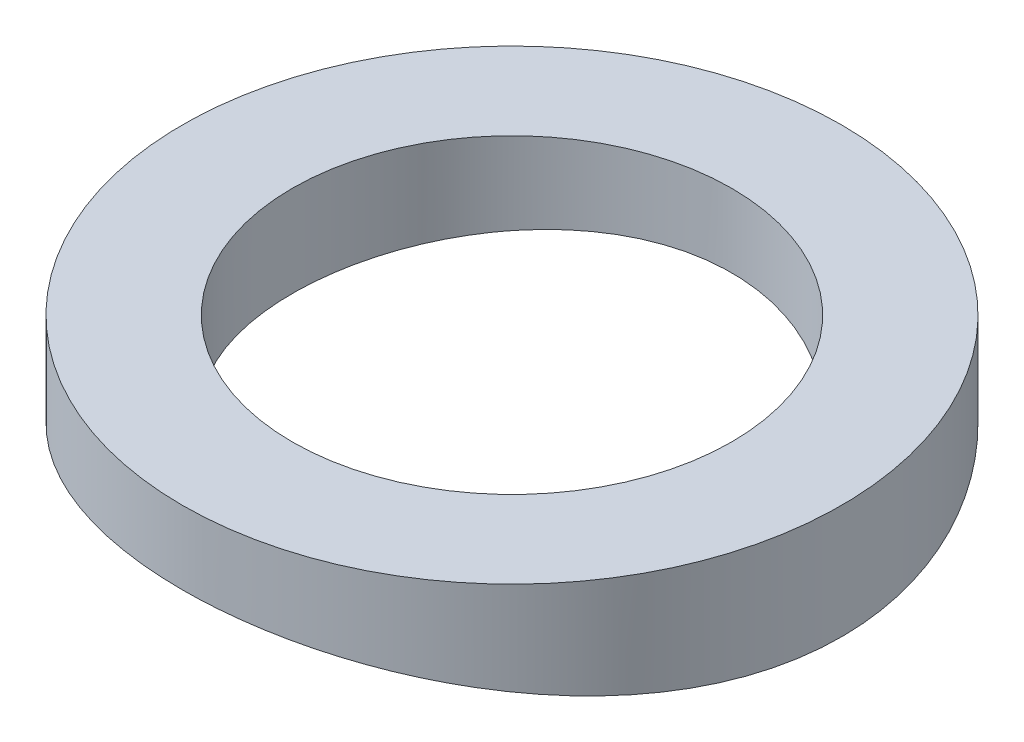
from build123d import *

# Parameters (mm, degrees)
ESQUISSE1_W           = 9
ESQUISSE1_H           = 4
EXTRUSION1_DEPTH      = 14.102674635
EXTRUSION1_DEPTH_BACK = 14.102674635
ESQUISSE2_R           = 37
ESQUISSE3_R           = 6
EXTRUSION2_DEPTH      = 14.102674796


with BuildPart() as part:
    # Esquisse1 → R_volution1 (revolve)
    with BuildSketch(Plane.XY, mode=Mode.PRIVATE) as r_volution1_sk:
        with Locations((-4.5, -1.11128311)):
            Rectangle(ESQUISSE1_W, ESQUISSE1_H)
    revolve(r_volution1_sk.sketch.rotate(Axis((0, 6.536895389, 0), (0, -1, 0)), 270), axis=Axis((0, 6.536895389, 0), (0, -1, 0)))

    # Esquisse2 → Extrusion1 (cut, two sides: drawn at the far end of the back side and taken through both)
    with BuildSketch(Plane.XY.offset(-EXTRUSION1_DEPTH_BACK)):
        with Locations((0, -38.11128311)):
            Circle(ESQUISSE2_R)
    extrude(amount=EXTRUSION1_DEPTH + EXTRUSION1_DEPTH_BACK, mode=Mode.SUBTRACT)

    # Esquisse3 → Extrusion2 (cut, through all)
    with BuildSketch(Plane(origin=(0, 0.88871689, 0), x_dir=(1, 0, 0), z_dir=(0, 1, 0))):
        with Locations(Location((0, 0, 0), (0, 0, 270))):
            Circle(ESQUISSE3_R)
    extrude(amount=-EXTRUSION2_DEPTH, mode=Mode.SUBTRACT)


solid = part.part
